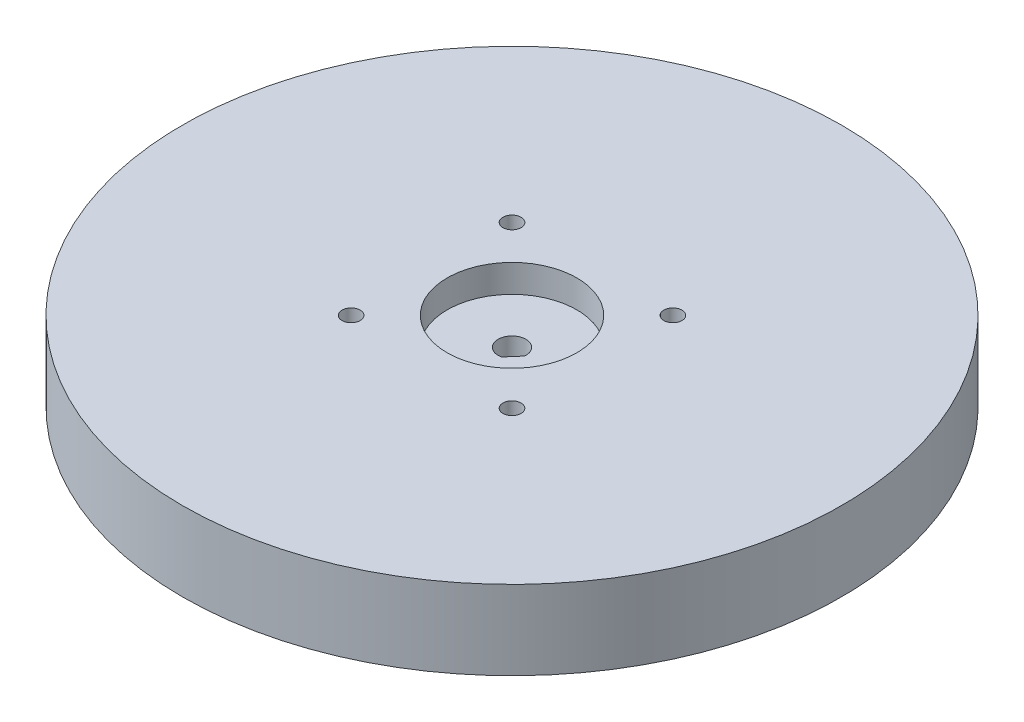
ISO-10303-21;
HEADER;
FILE_DESCRIPTION(('STEP AP214'),'2;1');
FILE_NAME('part.step','',(''),(''),'','','');
FILE_SCHEMA(('AUTOMOTIVE_DESIGN { 1 0 10303 214 1 1 1 1 }'));
ENDSEC;
DATA;
#1=APPLICATION_CONTEXT('core data for automotive mechanical design processes');
#2=APPLICATION_PROTOCOL_DEFINITION('international standard','automotive_design',2000,#1);
#3=PRODUCT_CONTEXT('',#1,'mechanical');
#4=PRODUCT('Part','Part','',(#3));
#5=PRODUCT_RELATED_PRODUCT_CATEGORY('part','',(#4));
#6=PRODUCT_DEFINITION_FORMATION('','',#4);
#7=PRODUCT_DEFINITION_CONTEXT('part definition',#1,'design');
#8=PRODUCT_DEFINITION('design','',#6,#7);
#9=PRODUCT_DEFINITION_SHAPE('','',#8);
#10=(LENGTH_UNIT() NAMED_UNIT(*) SI_UNIT(.MILLI.,.METRE.));
#11=(NAMED_UNIT(*) PLANE_ANGLE_UNIT() SI_UNIT($,.RADIAN.));
#12=(NAMED_UNIT(*) SI_UNIT($,.STERADIAN.) SOLID_ANGLE_UNIT());
#13=UNCERTAINTY_MEASURE_WITH_UNIT(LENGTH_MEASURE(1.E-05),#10,'distance_accuracy_value','');
#14=(GEOMETRIC_REPRESENTATION_CONTEXT(3) GLOBAL_UNCERTAINTY_ASSIGNED_CONTEXT((#13)) GLOBAL_UNIT_ASSIGNED_CONTEXT((#10,
#11,#12)) REPRESENTATION_CONTEXT('',''));
#15=CARTESIAN_POINT('',(0.,0.,0.));
#16=DIRECTION('',(0.,0.,1.));
#17=DIRECTION('',(1.,0.,0.));
#18=AXIS2_PLACEMENT_3D('',#15,#16,#17);
#19=CARTESIAN_POINT('',(1.64474842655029,0.,1.43369774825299));
#20=DIRECTION('',(0.75381483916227,0.,0.657086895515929));
#21=DIRECTION('',(0.657086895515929,0.,-0.75381483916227));
#22=AXIS2_PLACEMENT_3D('',#19,#20,#21);
#23=PLANE('',#22);
#24=DIRECTION('',(-0.657086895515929,0.,0.75381483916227));
#25=VECTOR('',#24,1.);
#26=CARTESIAN_POINT('',(1.64474842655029,9.906,1.43369774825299));
#27=LINE('',#26,#25);
#28=CARTESIAN_POINT('',(2.67079538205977,9.906,0.256609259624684));
#29=VERTEX_POINT('',#28);
#30=CARTESIAN_POINT('',(0.61870147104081,9.906,2.61078623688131));
#31=VERTEX_POINT('',#30);
#32=EDGE_CURVE('E56',#29,#31,#27,.T.);
#33=ORIENTED_EDGE('',*,*,#32,.F.);
#34=DIRECTION('',(0.,1.,0.));
#35=VECTOR('',#34,1.);
#36=CARTESIAN_POINT('',(2.67079538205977,0.,0.256609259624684));
#37=LINE('',#36,#35);
#38=CARTESIAN_POINT('',(2.67079538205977,0.,0.256609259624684));
#39=VERTEX_POINT('',#38);
#40=EDGE_CURVE('E72',#39,#29,#37,.T.);
#41=ORIENTED_EDGE('',*,*,#40,.F.);
#42=DIRECTION('',(0.657086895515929,0.,-0.753814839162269));
#43=VECTOR('',#42,1.);
#44=CARTESIAN_POINT('',(1.64474842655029,0.,1.43369774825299));
#45=LINE('',#44,#43);
#46=CARTESIAN_POINT('',(0.61870147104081,0.,2.61078623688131));
#47=VERTEX_POINT('',#46);
#48=EDGE_CURVE('E64',#47,#39,#45,.T.);
#49=ORIENTED_EDGE('',*,*,#48,.F.);
#50=DIRECTION('',(0.,1.,0.));
#51=VECTOR('',#50,1.);
#52=CARTESIAN_POINT('',(0.61870147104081,0.,2.61078623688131));
#53=LINE('',#52,#51);
#54=EDGE_CURVE('E74',#47,#31,#53,.T.);
#55=ORIENTED_EDGE('',*,*,#54,.T.);
#56=EDGE_LOOP('',(#33,#41,#49,#55));
#57=FACE_BOUND('',#56,.T.);
#58=ADVANCED_FACE('F43',(#57),#23,.F.);
#59=CARTESIAN_POINT('',(0.,0.,0.));
#60=DIRECTION('',(0.,1.,0.));
#61=DIRECTION('',(0.,0.,1.));
#62=AXIS2_PLACEMENT_3D('',#59,#60,#61);
#63=CYLINDRICAL_SURFACE('',#62,2.68309453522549);
#64=CARTESIAN_POINT('',(0.,9.906,0.));
#65=DIRECTION('',(0.,1.,0.));
#66=DIRECTION('',(0.,0.,1.));
#67=AXIS2_PLACEMENT_3D('',#64,#65,#66);
#68=CIRCLE('',#67,2.68309453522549);
#69=EDGE_CURVE('E11',#31,#29,#68,.F.);
#70=ORIENTED_EDGE('',*,*,#69,.F.);
#71=ORIENTED_EDGE('',*,*,#54,.F.);
#72=CARTESIAN_POINT('',(0.,0.,0.));
#73=DIRECTION('',(0.,1.,0.));
#74=DIRECTION('',(0.,0.,1.));
#75=AXIS2_PLACEMENT_3D('',#72,#73,#74);
#76=CIRCLE('',#75,2.68309453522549);
#77=EDGE_CURVE('E80',#39,#47,#76,.T.);
#78=ORIENTED_EDGE('',*,*,#77,.F.);
#79=ORIENTED_EDGE('',*,*,#40,.T.);
#80=EDGE_LOOP('',(#70,#71,#78,#79));
#81=FACE_BOUND('',#80,.T.);
#82=ADVANCED_FACE('F78',(#81),#63,.F.);
#83=CARTESIAN_POINT('',(0.,15.24,0.));
#84=DIRECTION('',(0.,-1.,0.));
#85=DIRECTION('',(0.,0.,-1.));
#86=AXIS2_PLACEMENT_3D('',#83,#84,#85);
#87=CYLINDRICAL_SURFACE('',#86,63.5);
#88=CARTESIAN_POINT('',(0.,15.24,0.));
#89=DIRECTION('',(0.,1.,0.));
#90=DIRECTION('',(0.,0.,1.));
#91=AXIS2_PLACEMENT_3D('',#88,#89,#90);
#92=CIRCLE('',#91,63.5);
#93=CARTESIAN_POINT('',(0.,15.24,-63.5));
#94=VERTEX_POINT('',#93);
#95=EDGE_CURVE('E51',#94,#94,#92,.T.);
#96=CARTESIAN_POINT('',(0.,0.,0.));
#97=DIRECTION('',(0.,1.,0.));
#98=DIRECTION('',(0.,0.,1.));
#99=AXIS2_PLACEMENT_3D('',#96,#97,#98);
#100=CIRCLE('',#99,63.5);
#101=CARTESIAN_POINT('',(0.,0.,-63.5));
#102=VERTEX_POINT('',#101);
#103=EDGE_CURVE('E82',#102,#102,#100,.T.);
#104=CARTESIAN_POINT('',(0.,15.24,-63.5));
#105=CARTESIAN_POINT('',(0.,15.08125,-63.5));
#106=CARTESIAN_POINT('',(0.,14.9225,-63.5));
#107=CARTESIAN_POINT('',(0.,14.605,-63.5));
#108=CARTESIAN_POINT('',(0.,14.44625,-63.5));
#109=CARTESIAN_POINT('',(0.,14.12875,-63.5));
#110=CARTESIAN_POINT('',(0.,13.97,-63.5));
#111=CARTESIAN_POINT('',(0.,13.6525,-63.5));
#112=CARTESIAN_POINT('',(0.,13.49375,-63.5));
#113=CARTESIAN_POINT('',(0.,13.17625,-63.5));
#114=CARTESIAN_POINT('',(0.,13.0175,-63.5));
#115=CARTESIAN_POINT('',(0.,12.7,-63.5));
#116=CARTESIAN_POINT('',(0.,12.54125,-63.5));
#117=CARTESIAN_POINT('',(0.,12.22375,-63.5));
#118=CARTESIAN_POINT('',(0.,12.065,-63.5));
#119=CARTESIAN_POINT('',(0.,11.7475,-63.5));
#120=CARTESIAN_POINT('',(0.,11.58875,-63.5));
#121=CARTESIAN_POINT('',(0.,11.27125,-63.5));
#122=CARTESIAN_POINT('',(0.,11.1125,-63.5));
#123=CARTESIAN_POINT('',(0.,10.795,-63.5));
#124=CARTESIAN_POINT('',(0.,10.63625,-63.5));
#125=CARTESIAN_POINT('',(0.,10.31875,-63.5));
#126=CARTESIAN_POINT('',(0.,10.16,-63.5));
#127=CARTESIAN_POINT('',(0.,9.8425,-63.5));
#128=CARTESIAN_POINT('',(0.,9.68375,-63.5));
#129=CARTESIAN_POINT('',(0.,9.36625,-63.5));
#130=CARTESIAN_POINT('',(0.,9.2075,-63.5));
#131=CARTESIAN_POINT('',(0.,8.89,-63.5));
#132=CARTESIAN_POINT('',(0.,8.73125,-63.5));
#133=CARTESIAN_POINT('',(0.,8.41375,-63.5));
#134=CARTESIAN_POINT('',(0.,8.255,-63.5));
#135=CARTESIAN_POINT('',(0.,7.9375,-63.5));
#136=CARTESIAN_POINT('',(0.,7.77875,-63.5));
#137=CARTESIAN_POINT('',(0.,7.46125,-63.5));
#138=CARTESIAN_POINT('',(0.,7.3025,-63.5));
#139=CARTESIAN_POINT('',(0.,6.985,-63.5));
#140=CARTESIAN_POINT('',(0.,6.82625,-63.5));
#141=CARTESIAN_POINT('',(0.,6.50875,-63.5));
#142=CARTESIAN_POINT('',(0.,6.35,-63.5));
#143=CARTESIAN_POINT('',(0.,6.0325,-63.5));
#144=CARTESIAN_POINT('',(0.,5.87375,-63.5));
#145=CARTESIAN_POINT('',(0.,5.55625,-63.5));
#146=CARTESIAN_POINT('',(0.,5.3975,-63.5));
#147=CARTESIAN_POINT('',(0.,5.08,-63.5));
#148=CARTESIAN_POINT('',(0.,4.92125,-63.5));
#149=CARTESIAN_POINT('',(0.,4.60375,-63.5));
#150=CARTESIAN_POINT('',(0.,4.445,-63.5));
#151=CARTESIAN_POINT('',(0.,4.1275,-63.5));
#152=CARTESIAN_POINT('',(0.,3.96875,-63.5));
#153=CARTESIAN_POINT('',(0.,3.65125,-63.5));
#154=CARTESIAN_POINT('',(0.,3.4925,-63.5));
#155=CARTESIAN_POINT('',(0.,3.175,-63.5));
#156=CARTESIAN_POINT('',(0.,3.01625,-63.5));
#157=CARTESIAN_POINT('',(0.,2.69875,-63.5));
#158=CARTESIAN_POINT('',(0.,2.54,-63.5));
#159=CARTESIAN_POINT('',(0.,2.2225,-63.5));
#160=CARTESIAN_POINT('',(0.,2.06375,-63.5));
#161=CARTESIAN_POINT('',(0.,1.74625,-63.5));
#162=CARTESIAN_POINT('',(0.,1.5875,-63.5));
#163=CARTESIAN_POINT('',(0.,1.27,-63.5));
#164=CARTESIAN_POINT('',(0.,1.11125,-63.5));
#165=CARTESIAN_POINT('',(0.,0.79375,-63.5));
#166=CARTESIAN_POINT('',(0.,0.634999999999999,-63.5));
#167=CARTESIAN_POINT('',(0.,0.3175,-63.5));
#168=CARTESIAN_POINT('',(0.,0.15875,-63.5));
#169=CARTESIAN_POINT('',(0.,0.,-63.5));
#170=B_SPLINE_CURVE_WITH_KNOTS('',3,(#104,#105,#106,#107,#108,#109,#110,#111,#112,#113,#114,
#115,#116,#117,#118,#119,#120,#121,#122,#123,#124,#125,#126,#127,#128,#129,#130,#131,#132,#133,
#134,#135,#136,#137,#138,#139,#140,#141,#142,#143,#144,#145,#146,#147,#148,#149,#150,#151,#152,
#153,#154,#155,#156,#157,#158,#159,#160,#161,#162,#163,#164,#165,#166,#167,#168,#169),
.UNSPECIFIED.,.F.,.F.,(4,2,2,2,2,2,2,2,2,2,2,2,2,2,2,2,2,2,2,2,2,2,2,2,2,2,2,2,2,2,2,2,4),(0.,
0.476250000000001,0.9525,1.42875,1.905,2.38125,2.8575,3.33375,3.81,4.28625,4.7625,5.23875,5.715,
6.19125,6.6675,7.14375,7.62,8.09625,8.5725,9.04875,9.525,10.00125,10.4775,10.95375,11.43,
11.90625,12.3825,12.85875,13.335,13.81125,14.2875,14.76375,15.24),.UNSPECIFIED.);
#171=EDGE_CURVE('BSEAM45',#94,#102,#170,.T.);
#172=ORIENTED_EDGE('',*,*,#95,.F.);
#173=ORIENTED_EDGE('',*,*,#103,.T.);
#174=ORIENTED_EDGE('',*,*,#171,.T.);
#175=ORIENTED_EDGE('',*,*,#171,.F.);
#176=EDGE_LOOP('',(#172,#174,#173,#175));
#177=FACE_BOUND('',#176,.T.);
#178=ADVANCED_FACE('F45',(#177),#87,.T.);
#179=CARTESIAN_POINT('',(0.,15.24,0.));
#180=DIRECTION('',(0.,1.,0.));
#181=DIRECTION('',(0.,0.,1.));
#182=AXIS2_PLACEMENT_3D('',#179,#180,#181);
#183=PLANE('',#182);
#184=CARTESIAN_POINT('',(0.,15.24,0.));
#185=DIRECTION('',(0.,1.,0.));
#186=DIRECTION('',(0.,0.,1.));
#187=AXIS2_PLACEMENT_3D('',#184,#185,#186);
#188=CIRCLE('',#187,12.5);
#189=CARTESIAN_POINT('',(0.,15.24,12.5));
#190=VERTEX_POINT('',#189);
#191=EDGE_CURVE('E116',#190,#190,#188,.T.);
#192=ORIENTED_EDGE('',*,*,#191,.F.);
#193=EDGE_LOOP('',(#192));
#194=FACE_BOUND('',#193,.T.);
#195=CARTESIAN_POINT('',(-15.5,15.24,15.5));
#196=DIRECTION('',(0.,1.,0.));
#197=DIRECTION('',(0.,0.,1.));
#198=AXIS2_PLACEMENT_3D('',#195,#196,#197);
#199=CIRCLE('',#198,1.75);
#200=CARTESIAN_POINT('',(-15.5,15.24,17.25));
#201=VERTEX_POINT('',#200);
#202=EDGE_CURVE('E75',#201,#201,#199,.T.);
#203=ORIENTED_EDGE('',*,*,#202,.F.);
#204=EDGE_LOOP('',(#203));
#205=FACE_BOUND('',#204,.T.);
#206=CARTESIAN_POINT('',(15.5,15.24,15.5));
#207=DIRECTION('',(0.,1.,0.));
#208=DIRECTION('',(0.,0.,1.));
#209=AXIS2_PLACEMENT_3D('',#206,#207,#208);
#210=CIRCLE('',#209,1.75);
#211=CARTESIAN_POINT('',(15.5,15.24,17.25));
#212=VERTEX_POINT('',#211);
#213=EDGE_CURVE('E111',#212,#212,#210,.T.);
#214=ORIENTED_EDGE('',*,*,#213,.F.);
#215=EDGE_LOOP('',(#214));
#216=FACE_BOUND('',#215,.T.);
#217=CARTESIAN_POINT('',(15.5,15.24,-15.5));
#218=DIRECTION('',(0.,1.,0.));
#219=DIRECTION('',(0.,0.,1.));
#220=AXIS2_PLACEMENT_3D('',#217,#218,#219);
#221=CIRCLE('',#220,1.75);
#222=CARTESIAN_POINT('',(15.5,15.24,-13.75));
#223=VERTEX_POINT('',#222);
#224=EDGE_CURVE('E108',#223,#223,#221,.T.);
#225=ORIENTED_EDGE('',*,*,#224,.F.);
#226=EDGE_LOOP('',(#225));
#227=FACE_BOUND('',#226,.T.);
#228=CARTESIAN_POINT('',(-15.5,15.24,-15.5));
#229=DIRECTION('',(0.,1.,0.));
#230=DIRECTION('',(0.,0.,1.));
#231=AXIS2_PLACEMENT_3D('',#228,#229,#230);
#232=CIRCLE('',#231,1.75);
#233=CARTESIAN_POINT('',(-15.5,15.24,-13.75));
#234=VERTEX_POINT('',#233);
#235=EDGE_CURVE('E94',#234,#234,#232,.T.);
#236=ORIENTED_EDGE('',*,*,#235,.F.);
#237=EDGE_LOOP('',(#236));
#238=FACE_BOUND('',#237,.T.);
#239=ORIENTED_EDGE('',*,*,#95,.T.);
#240=EDGE_LOOP('',(#239));
#241=FACE_BOUND('',#240,.T.);
#242=ADVANCED_FACE('F129',(#194,#205,#216,#227,#238,#241),#183,.T.);
#243=CARTESIAN_POINT('',(0.,0.,0.));
#244=DIRECTION('',(0.,1.,0.));
#245=DIRECTION('',(0.,0.,1.));
#246=AXIS2_PLACEMENT_3D('',#243,#244,#245);
#247=PLANE('',#246);
#248=CARTESIAN_POINT('',(-15.5,0.,15.5));
#249=DIRECTION('',(0.,1.,0.));
#250=DIRECTION('',(0.,0.,1.));
#251=AXIS2_PLACEMENT_3D('',#248,#249,#250);
#252=CIRCLE('',#251,1.75);
#253=CARTESIAN_POINT('',(-15.5,0.,17.25));
#254=VERTEX_POINT('',#253);
#255=EDGE_CURVE('E99',#254,#254,#252,.T.);
#256=ORIENTED_EDGE('',*,*,#255,.T.);
#257=EDGE_LOOP('',(#256));
#258=FACE_BOUND('',#257,.T.);
#259=CARTESIAN_POINT('',(15.5,0.,15.5));
#260=DIRECTION('',(0.,1.,0.));
#261=DIRECTION('',(0.,0.,1.));
#262=AXIS2_PLACEMENT_3D('',#259,#260,#261);
#263=CIRCLE('',#262,1.75);
#264=CARTESIAN_POINT('',(15.5,0.,17.25));
#265=VERTEX_POINT('',#264);
#266=EDGE_CURVE('E97',#265,#265,#263,.T.);
#267=ORIENTED_EDGE('',*,*,#266,.T.);
#268=EDGE_LOOP('',(#267));
#269=FACE_BOUND('',#268,.T.);
#270=CARTESIAN_POINT('',(15.5,0.,-15.5));
#271=DIRECTION('',(0.,1.,0.));
#272=DIRECTION('',(0.,0.,1.));
#273=AXIS2_PLACEMENT_3D('',#270,#271,#272);
#274=CIRCLE('',#273,1.75);
#275=CARTESIAN_POINT('',(15.5,0.,-13.75));
#276=VERTEX_POINT('',#275);
#277=EDGE_CURVE('E93',#276,#276,#274,.T.);
#278=ORIENTED_EDGE('',*,*,#277,.T.);
#279=EDGE_LOOP('',(#278));
#280=FACE_BOUND('',#279,.T.);
#281=CARTESIAN_POINT('',(-15.5,0.,-15.5));
#282=DIRECTION('',(0.,1.,0.));
#283=DIRECTION('',(0.,0.,1.));
#284=AXIS2_PLACEMENT_3D('',#281,#282,#283);
#285=CIRCLE('',#284,1.75);
#286=CARTESIAN_POINT('',(-15.5,0.,-13.75));
#287=VERTEX_POINT('',#286);
#288=EDGE_CURVE('E90',#287,#287,#285,.T.);
#289=ORIENTED_EDGE('',*,*,#288,.T.);
#290=EDGE_LOOP('',(#289));
#291=FACE_BOUND('',#290,.T.);
#292=ORIENTED_EDGE('',*,*,#77,.T.);
#293=ORIENTED_EDGE('',*,*,#48,.T.);
#294=EDGE_LOOP('',(#292,#293));
#295=FACE_BOUND('',#294,.T.);
#296=ORIENTED_EDGE('',*,*,#103,.F.);
#297=EDGE_LOOP('',(#296));
#298=FACE_BOUND('',#297,.T.);
#299=ADVANCED_FACE('F132',(#258,#269,#280,#291,#295,#298),#247,.F.);
#300=CARTESIAN_POINT('',(-15.5,-40.386,-15.5));
#301=DIRECTION('',(0.,1.,0.));
#302=DIRECTION('',(0.,0.,1.));
#303=AXIS2_PLACEMENT_3D('',#300,#301,#302);
#304=CYLINDRICAL_SURFACE('',#303,1.75);
#305=ORIENTED_EDGE('',*,*,#235,.T.);
#306=EDGE_LOOP('',(#305));
#307=FACE_BOUND('',#306,.T.);
#308=ORIENTED_EDGE('',*,*,#288,.F.);
#309=EDGE_LOOP('',(#308));
#310=FACE_BOUND('',#309,.T.);
#311=ADVANCED_FACE('F149',(#307,#310),#304,.F.);
#312=CARTESIAN_POINT('',(15.5,-40.386,-15.5));
#313=DIRECTION('',(0.,1.,0.));
#314=DIRECTION('',(0.,0.,1.));
#315=AXIS2_PLACEMENT_3D('',#312,#313,#314);
#316=CYLINDRICAL_SURFACE('',#315,1.75);
#317=ORIENTED_EDGE('',*,*,#224,.T.);
#318=EDGE_LOOP('',(#317));
#319=FACE_BOUND('',#318,.T.);
#320=ORIENTED_EDGE('',*,*,#277,.F.);
#321=EDGE_LOOP('',(#320));
#322=FACE_BOUND('',#321,.T.);
#323=ADVANCED_FACE('F153',(#319,#322),#316,.F.);
#324=CARTESIAN_POINT('',(15.5,-40.386,15.5));
#325=DIRECTION('',(0.,1.,0.));
#326=DIRECTION('',(0.,0.,1.));
#327=AXIS2_PLACEMENT_3D('',#324,#325,#326);
#328=CYLINDRICAL_SURFACE('',#327,1.75);
#329=ORIENTED_EDGE('',*,*,#213,.T.);
#330=EDGE_LOOP('',(#329));
#331=FACE_BOUND('',#330,.T.);
#332=ORIENTED_EDGE('',*,*,#266,.F.);
#333=EDGE_LOOP('',(#332));
#334=FACE_BOUND('',#333,.T.);
#335=ADVANCED_FACE('F167',(#331,#334),#328,.F.);
#336=CARTESIAN_POINT('',(-15.5,-40.386,15.5));
#337=DIRECTION('',(0.,1.,0.));
#338=DIRECTION('',(0.,0.,1.));
#339=AXIS2_PLACEMENT_3D('',#336,#337,#338);
#340=CYLINDRICAL_SURFACE('',#339,1.75);
#341=ORIENTED_EDGE('',*,*,#202,.T.);
#342=EDGE_LOOP('',(#341));
#343=FACE_BOUND('',#342,.T.);
#344=ORIENTED_EDGE('',*,*,#255,.F.);
#345=EDGE_LOOP('',(#344));
#346=FACE_BOUND('',#345,.T.);
#347=ADVANCED_FACE('F165',(#343,#346),#340,.F.);
#348=CARTESIAN_POINT('',(0.,9.906,0.));
#349=DIRECTION('',(0.,1.,0.));
#350=DIRECTION('',(0.,0.,1.));
#351=AXIS2_PLACEMENT_3D('',#348,#349,#350);
#352=PLANE('',#351);
#353=CARTESIAN_POINT('',(0.,9.906,0.));
#354=DIRECTION('',(0.,1.,0.));
#355=DIRECTION('',(0.,0.,1.));
#356=AXIS2_PLACEMENT_3D('',#353,#354,#355);
#357=CIRCLE('',#356,12.5);
#358=CARTESIAN_POINT('',(0.,9.906,12.5));
#359=VERTEX_POINT('',#358);
#360=EDGE_CURVE('E76',#359,#359,#357,.T.);
#361=ORIENTED_EDGE('',*,*,#360,.T.);
#362=EDGE_LOOP('',(#361));
#363=FACE_BOUND('',#362,.T.);
#364=ORIENTED_EDGE('',*,*,#32,.T.);
#365=ORIENTED_EDGE('',*,*,#69,.T.);
#366=EDGE_LOOP('',(#364,#365));
#367=FACE_BOUND('',#366,.T.);
#368=ADVANCED_FACE('F69',(#363,#367),#352,.T.);
#369=CARTESIAN_POINT('',(0.,9.906,0.));
#370=DIRECTION('',(0.,1.,0.));
#371=DIRECTION('',(0.,0.,1.));
#372=AXIS2_PLACEMENT_3D('',#369,#370,#371);
#373=CYLINDRICAL_SURFACE('',#372,12.5);
#374=ORIENTED_EDGE('',*,*,#360,.F.);
#375=EDGE_LOOP('',(#374));
#376=FACE_BOUND('',#375,.T.);
#377=ORIENTED_EDGE('',*,*,#191,.T.);
#378=EDGE_LOOP('',(#377));
#379=FACE_BOUND('',#378,.T.);
#380=ADVANCED_FACE('F123',(#376,#379),#373,.F.);
#381=CLOSED_SHELL('',(#58,#82,#178,#242,#299,#311,#323,#335,#347,#368,#380));
#382=MANIFOLD_SOLID_BREP('B2',#381);
#383=ADVANCED_BREP_SHAPE_REPRESENTATION('',(#18,#382),#14);
#384=SHAPE_DEFINITION_REPRESENTATION(#9,#383);
ENDSEC;
END-ISO-10303-21;
